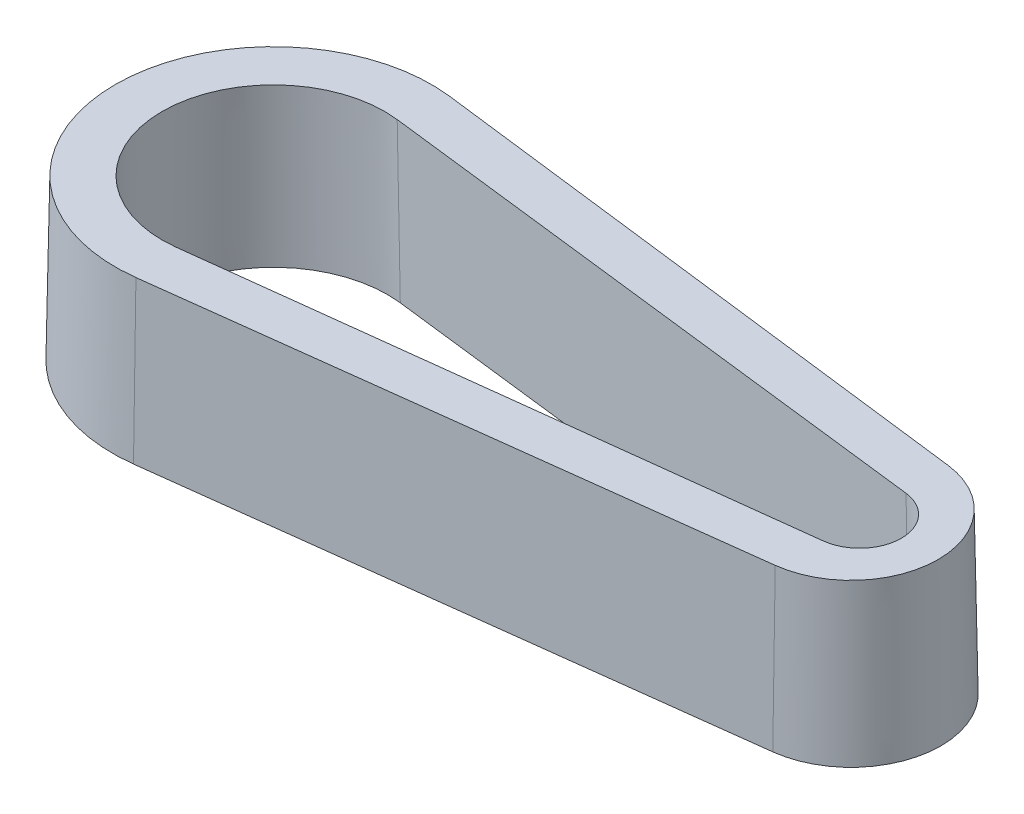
from build123d import *

# Parameters (mm, degrees)
BOSS_EXTRUDE1_DEPTH = 11.43
DRAFT1_ANGLE        = 1
DRAFT4_ANGLE        = -1


with BuildPart() as part:
    # Sketch1 → Boss-Extrude1 (new body)
    with BuildSketch(Plane(origin=(0, 0, 0), x_dir=(1, 0, 0), z_dir=(0, 1, 0))):
        with BuildLine():
            Line((1.411482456, 11.406500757), (42.051482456, 6.377557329))
            ThreePointArc((42.051482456, 6.377557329), (47.6885, 0), (42.051482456, -6.377557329))
            Line((42.051482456, -6.377557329), (1.411482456, -11.406500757))
            ThreePointArc((1.411482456, -11.406500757), (-11.4935, 0), (1.411482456, 11.406500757))
        make_face()
        with BuildLine():
            Line((0.969112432, 8.095600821), (42.26198023, 3.152492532))
            ThreePointArc((42.26198023, 3.152492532), (45.0596, 0), (42.26198023, -3.152492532))
            Line((42.26198023, -3.152492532), (0.969112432, -8.095600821))
            ThreePointArc((0.969112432, -8.095600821), (-8.1534, 0), (0.969112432, 8.095600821))
        make_face(mode=Mode.SUBTRACT)
    extrude(amount=BOSS_EXTRUDE1_DEPTH)

    # Draft1
    draft1_faces = [part.faces().sort_by_distance(p)[0] for p in [
        (45.0596, 5.715, 0),
        (21.615546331, 5.715, 5.624046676),
        (-8.1534, 5.715, 0),
        (21.615546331, 5.715, -5.624046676),
    ]]
    draft(draft1_faces, Plane(origin=(0, 0, 0), x_dir=(0, 0, -1), z_dir=(0, -1, 0)), DRAFT1_ANGLE)

    # Draft4
    draft4_faces = [part.faces().sort_by_distance(p)[0] for p in [
        (-11.4935, 5.715, 0),
        (47.6885, 5.715, 0),
        (21.731482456, 5.715, -8.892029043),
        (21.731482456, 5.715, 8.892029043),
    ]]
    draft(draft4_faces, Plane(origin=(0, 0, 0), x_dir=(0, 0, -1), z_dir=(0, -1, 0)), DRAFT4_ANGLE)


solid = part.part
